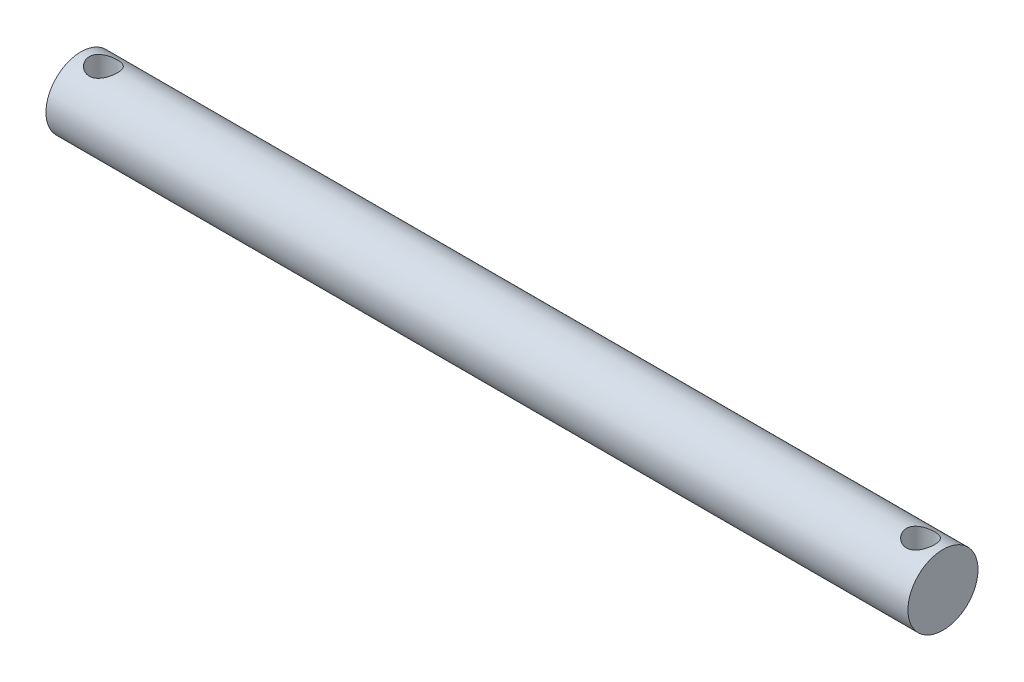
from build123d import *

# Parameters (mm, degrees)
SKETCH1_R               = 6.35
BOSS_EXTRUDE1_DEPTH     = 78.105
CUT_EXTRUDE1_DEPTH      = 79.619565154
CUT_EXTRUDE1_DEPTH_BACK = 79.619565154
SKETCH2_R               = 2.5527


with BuildPart() as part:
    # Sketch1 → Boss-Extrude1 (new, symmetric)
    with BuildSketch(Plane(origin=(0, 0, 0), x_dir=(0, 0, -1), z_dir=(1, 0, 0))):
        Circle(SKETCH1_R)
    extrude(amount=BOSS_EXTRUDE1_DEPTH, both=True)

    # Sketch2 → Cut-Extrude1 (cut, two sides: drawn at the far end of the back side and taken through both)
    with BuildSketch(Plane(origin=(0, 0, 0), x_dir=(1, 0, 0), z_dir=(0, 1, 0)).offset(-CUT_EXTRUDE1_DEPTH_BACK)):
        with Locations(Location((74.041, 0, 0), (0, 0, 270))):
            Circle(SKETCH2_R)
        with Locations(Location((-74.041, 0, 0), (0, 0, 270))):
            Circle(SKETCH2_R)
    extrude(amount=CUT_EXTRUDE1_DEPTH + CUT_EXTRUDE1_DEPTH_BACK, mode=Mode.SUBTRACT)


solid = part.part
